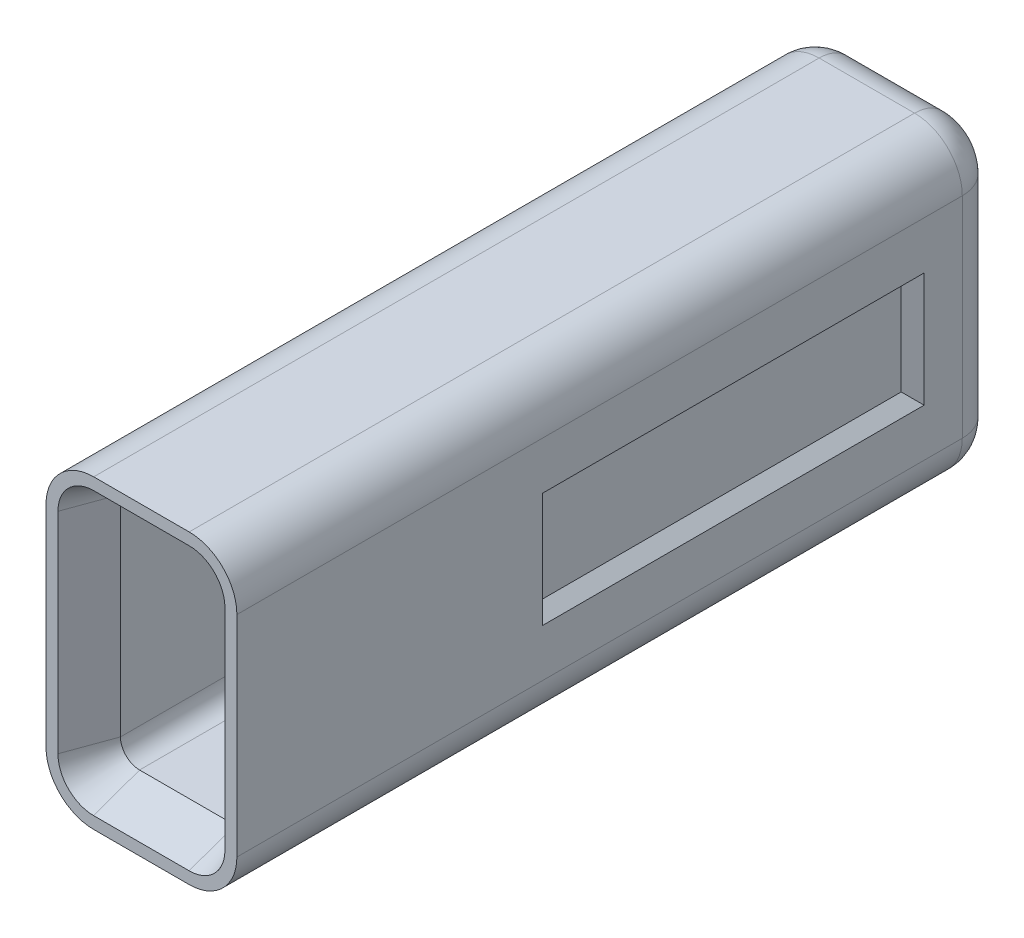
ISO-10303-21;
HEADER;
FILE_DESCRIPTION(('STEP AP214'),'2;1');
FILE_NAME('part.step','',(''),(''),'','','');
FILE_SCHEMA(('AUTOMOTIVE_DESIGN { 1 0 10303 214 1 1 1 1 }'));
ENDSEC;
DATA;
#1=APPLICATION_CONTEXT('core data for automotive mechanical design processes');
#2=APPLICATION_PROTOCOL_DEFINITION('international standard','automotive_design',2000,#1);
#3=PRODUCT_CONTEXT('',#1,'mechanical');
#4=PRODUCT('Part','Part','',(#3));
#5=PRODUCT_RELATED_PRODUCT_CATEGORY('part','',(#4));
#6=PRODUCT_DEFINITION_FORMATION('','',#4);
#7=PRODUCT_DEFINITION_CONTEXT('part definition',#1,'design');
#8=PRODUCT_DEFINITION('design','',#6,#7);
#9=PRODUCT_DEFINITION_SHAPE('','',#8);
#10=(LENGTH_UNIT() NAMED_UNIT(*) SI_UNIT(.MILLI.,.METRE.));
#11=(NAMED_UNIT(*) PLANE_ANGLE_UNIT() SI_UNIT($,.RADIAN.));
#12=(NAMED_UNIT(*) SI_UNIT($,.STERADIAN.) SOLID_ANGLE_UNIT());
#13=UNCERTAINTY_MEASURE_WITH_UNIT(LENGTH_MEASURE(1.E-05),#10,'distance_accuracy_value','');
#14=(GEOMETRIC_REPRESENTATION_CONTEXT(3) GLOBAL_UNCERTAINTY_ASSIGNED_CONTEXT((#13)) GLOBAL_UNIT_ASSIGNED_CONTEXT((#10,
#11,#12)) REPRESENTATION_CONTEXT('',''));
#15=CARTESIAN_POINT('',(0.,0.,0.));
#16=DIRECTION('',(0.,0.,1.));
#17=DIRECTION('',(1.,0.,0.));
#18=AXIS2_PLACEMENT_3D('',#15,#16,#17);
#19=CARTESIAN_POINT('',(2.5,2.75,19.));
#20=DIRECTION('',(-1.,0.,0.));
#21=DIRECTION('',(0.,0.,1.));
#22=AXIS2_PLACEMENT_3D('',#19,#20,#21);
#23=PLANE('',#22);
#24=DIRECTION('',(0.,0.,-1.));
#25=VECTOR('',#24,1.);
#26=CARTESIAN_POINT('',(2.5,-2.75,19.));
#27=LINE('',#26,#25);
#28=CARTESIAN_POINT('',(2.5,-2.75,19.));
#29=VERTEX_POINT('',#28);
#30=CARTESIAN_POINT('',(2.5,-2.75,0.));
#31=VERTEX_POINT('',#30);
#32=EDGE_CURVE('E353',#29,#31,#27,.T.);
#33=ORIENTED_EDGE('',*,*,#32,.T.);
#34=DIRECTION('',(0.,-1.,0.));
#35=VECTOR('',#34,1.);
#36=CARTESIAN_POINT('',(2.5,2.75,0.));
#37=LINE('',#36,#35);
#38=CARTESIAN_POINT('',(2.5,2.75,0.));
#39=VERTEX_POINT('',#38);
#40=EDGE_CURVE('E444',#31,#39,#37,.F.);
#41=ORIENTED_EDGE('',*,*,#40,.T.);
#42=DIRECTION('',(0.,0.,-1.));
#43=VECTOR('',#42,1.);
#44=CARTESIAN_POINT('',(2.5,2.75,19.));
#45=LINE('',#44,#43);
#46=CARTESIAN_POINT('',(2.5,2.75,19.));
#47=VERTEX_POINT('',#46);
#48=EDGE_CURVE('E350',#47,#39,#45,.T.);
#49=ORIENTED_EDGE('',*,*,#48,.F.);
#50=DIRECTION('',(0.,1.,0.));
#51=VECTOR('',#50,1.);
#52=CARTESIAN_POINT('',(2.5,2.75,19.));
#53=LINE('',#52,#51);
#54=EDGE_CURVE('E328',#29,#47,#53,.T.);
#55=ORIENTED_EDGE('',*,*,#54,.F.);
#56=EDGE_LOOP('',(#33,#41,#49,#55));
#57=FACE_BOUND('',#56,.T.);
#58=DIRECTION('',(0.,0.,1.));
#59=VECTOR('',#58,1.);
#60=CARTESIAN_POINT('',(2.5,-1.5,1.));
#61=LINE('',#60,#59);
#62=CARTESIAN_POINT('',(2.5,-1.5,1.));
#63=VERTEX_POINT('',#62);
#64=CARTESIAN_POINT('',(2.5,-1.5,11.));
#65=VERTEX_POINT('',#64);
#66=EDGE_CURVE('E255',#63,#65,#61,.T.);
#67=ORIENTED_EDGE('',*,*,#66,.T.);
#68=DIRECTION('',(0.,1.,0.));
#69=VECTOR('',#68,1.);
#70=CARTESIAN_POINT('',(2.5,-1.5,11.));
#71=LINE('',#70,#69);
#72=CARTESIAN_POINT('',(2.5,1.5,11.));
#73=VERTEX_POINT('',#72);
#74=EDGE_CURVE('E262',#65,#73,#71,.T.);
#75=ORIENTED_EDGE('',*,*,#74,.T.);
#76=DIRECTION('',(0.,0.,1.));
#77=VECTOR('',#76,1.);
#78=CARTESIAN_POINT('',(2.5,1.5,1.));
#79=LINE('',#78,#77);
#80=CARTESIAN_POINT('',(2.5,1.5,1.));
#81=VERTEX_POINT('',#80);
#82=EDGE_CURVE('E259',#81,#73,#79,.T.);
#83=ORIENTED_EDGE('',*,*,#82,.F.);
#84=DIRECTION('',(0.,1.,0.));
#85=VECTOR('',#84,1.);
#86=CARTESIAN_POINT('',(2.5,-1.5,1.));
#87=LINE('',#86,#85);
#88=EDGE_CURVE('E248',#63,#81,#87,.T.);
#89=ORIENTED_EDGE('',*,*,#88,.F.);
#90=EDGE_LOOP('',(#67,#75,#83,#89));
#91=FACE_BOUND('',#90,.T.);
#92=ADVANCED_FACE('F35',(#57,#91),#23,.F.);
#93=CARTESIAN_POINT('',(-2.5,-2.75,19.));
#94=DIRECTION('',(1.,0.,0.));
#95=DIRECTION('',(0.,0.,-1.));
#96=AXIS2_PLACEMENT_3D('',#93,#94,#95);
#97=PLANE('',#96);
#98=DIRECTION('',(0.,0.,-1.));
#99=VECTOR('',#98,1.);
#100=CARTESIAN_POINT('',(-2.5,2.75,19.));
#101=LINE('',#100,#99);
#102=CARTESIAN_POINT('',(-2.5,2.75,19.));
#103=VERTEX_POINT('',#102);
#104=CARTESIAN_POINT('',(-2.5,2.75,0.));
#105=VERTEX_POINT('',#104);
#106=EDGE_CURVE('E341',#103,#105,#101,.T.);
#107=ORIENTED_EDGE('',*,*,#106,.T.);
#108=DIRECTION('',(0.,1.,0.));
#109=VECTOR('',#108,1.);
#110=CARTESIAN_POINT('',(-2.5,-2.75,0.));
#111=LINE('',#110,#109);
#112=CARTESIAN_POINT('',(-2.5,-2.75,0.));
#113=VERTEX_POINT('',#112);
#114=EDGE_CURVE('E435',#105,#113,#111,.F.);
#115=ORIENTED_EDGE('',*,*,#114,.T.);
#116=DIRECTION('',(0.,0.,-1.));
#117=VECTOR('',#116,1.);
#118=CARTESIAN_POINT('',(-2.5,-2.75,19.));
#119=LINE('',#118,#117);
#120=CARTESIAN_POINT('',(-2.5,-2.75,19.));
#121=VERTEX_POINT('',#120);
#122=EDGE_CURVE('E338',#121,#113,#119,.T.);
#123=ORIENTED_EDGE('',*,*,#122,.F.);
#124=DIRECTION('',(0.,-1.,0.));
#125=VECTOR('',#124,1.);
#126=CARTESIAN_POINT('',(-2.5,-2.75,19.));
#127=LINE('',#126,#125);
#128=EDGE_CURVE('E336',#103,#121,#127,.T.);
#129=ORIENTED_EDGE('',*,*,#128,.F.);
#130=EDGE_LOOP('',(#107,#115,#123,#129));
#131=FACE_BOUND('',#130,.T.);
#132=DIRECTION('',(0.,0.,1.));
#133=VECTOR('',#132,1.);
#134=CARTESIAN_POINT('',(-2.5,-1.5,1.));
#135=LINE('',#134,#133);
#136=CARTESIAN_POINT('',(-2.5,-1.5,1.));
#137=VERTEX_POINT('',#136);
#138=CARTESIAN_POINT('',(-2.5,-1.5,11.));
#139=VERTEX_POINT('',#138);
#140=EDGE_CURVE('E268',#137,#139,#135,.T.);
#141=ORIENTED_EDGE('',*,*,#140,.F.);
#142=DIRECTION('',(0.,1.,0.));
#143=VECTOR('',#142,1.);
#144=CARTESIAN_POINT('',(-2.5,-1.5,1.));
#145=LINE('',#144,#143);
#146=CARTESIAN_POINT('',(-2.5,1.5,1.));
#147=VERTEX_POINT('',#146);
#148=EDGE_CURVE('E275',#137,#147,#145,.T.);
#149=ORIENTED_EDGE('',*,*,#148,.T.);
#150=DIRECTION('',(0.,0.,1.));
#151=VECTOR('',#150,1.);
#152=CARTESIAN_POINT('',(-2.5,1.5,1.));
#153=LINE('',#152,#151);
#154=CARTESIAN_POINT('',(-2.5,1.5,11.));
#155=VERTEX_POINT('',#154);
#156=EDGE_CURVE('E272',#147,#155,#153,.T.);
#157=ORIENTED_EDGE('',*,*,#156,.T.);
#158=DIRECTION('',(0.,1.,0.));
#159=VECTOR('',#158,1.);
#160=CARTESIAN_POINT('',(-2.5,-1.5,11.));
#161=LINE('',#160,#159);
#162=EDGE_CURVE('E271',#139,#155,#161,.T.);
#163=ORIENTED_EDGE('',*,*,#162,.F.);
#164=EDGE_LOOP('',(#141,#149,#157,#163));
#165=FACE_BOUND('',#164,.T.);
#166=ADVANCED_FACE('F512',(#131,#165),#97,.F.);
#167=CARTESIAN_POINT('',(-1.25,-2.75,19.));
#168=DIRECTION('',(0.,0.,-1.));
#169=DIRECTION('',(-1.,0.,0.));
#170=AXIS2_PLACEMENT_3D('',#167,#168,#169);
#171=PLANE('',#170);
#172=CARTESIAN_POINT('',(1.25,-2.75,19.));
#173=DIRECTION('',(0.,0.,-1.));
#174=DIRECTION('',(-1.,0.,0.));
#175=AXIS2_PLACEMENT_3D('',#172,#173,#174);
#176=CIRCLE('',#175,0.936764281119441);
#177=CARTESIAN_POINT('',(2.18676428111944,-2.74999999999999,19.));
#178=VERTEX_POINT('',#177);
#179=CARTESIAN_POINT('',(1.25,-3.68676428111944,19.));
#180=VERTEX_POINT('',#179);
#181=EDGE_CURVE('E377',#178,#180,#176,.T.);
#182=ORIENTED_EDGE('',*,*,#181,.T.);
#183=DIRECTION('',(-1.,0.,0.));
#184=VECTOR('',#183,1.);
#185=CARTESIAN_POINT('',(-1.25,-3.68676428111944,19.));
#186=LINE('',#185,#184);
#187=CARTESIAN_POINT('',(-1.25,-3.68676428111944,19.));
#188=VERTEX_POINT('',#187);
#189=EDGE_CURVE('E379',#180,#188,#186,.T.);
#190=ORIENTED_EDGE('',*,*,#189,.T.);
#191=CARTESIAN_POINT('',(-1.25,-2.75,19.));
#192=DIRECTION('',(0.,0.,-1.));
#193=DIRECTION('',(-1.,0.,0.));
#194=AXIS2_PLACEMENT_3D('',#191,#192,#193);
#195=CIRCLE('',#194,0.936764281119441);
#196=CARTESIAN_POINT('',(-2.18676428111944,-2.75,19.));
#197=VERTEX_POINT('',#196);
#198=EDGE_CURVE('E365',#188,#197,#195,.T.);
#199=ORIENTED_EDGE('',*,*,#198,.T.);
#200=DIRECTION('',(0.,1.,0.));
#201=VECTOR('',#200,1.);
#202=CARTESIAN_POINT('',(-2.18676428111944,2.75,19.));
#203=LINE('',#202,#201);
#204=CARTESIAN_POINT('',(-2.18676428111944,2.74999999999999,19.));
#205=VERTEX_POINT('',#204);
#206=EDGE_CURVE('E367',#197,#205,#203,.T.);
#207=ORIENTED_EDGE('',*,*,#206,.T.);
#208=CARTESIAN_POINT('',(-1.25,2.75,19.));
#209=DIRECTION('',(0.,0.,-1.));
#210=DIRECTION('',(-1.,0.,0.));
#211=AXIS2_PLACEMENT_3D('',#208,#209,#210);
#212=CIRCLE('',#211,0.936764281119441);
#213=CARTESIAN_POINT('',(-1.25,3.68676428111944,19.));
#214=VERTEX_POINT('',#213);
#215=EDGE_CURVE('E369',#205,#214,#212,.T.);
#216=ORIENTED_EDGE('',*,*,#215,.T.);
#217=DIRECTION('',(1.,0.,0.));
#218=VECTOR('',#217,1.);
#219=CARTESIAN_POINT('',(1.25,3.68676428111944,19.));
#220=LINE('',#219,#218);
#221=CARTESIAN_POINT('',(1.24999999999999,3.68676428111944,19.));
#222=VERTEX_POINT('',#221);
#223=EDGE_CURVE('E371',#214,#222,#220,.T.);
#224=ORIENTED_EDGE('',*,*,#223,.T.);
#225=CARTESIAN_POINT('',(1.25,2.75,19.));
#226=DIRECTION('',(0.,0.,-1.));
#227=DIRECTION('',(-1.,0.,0.));
#228=AXIS2_PLACEMENT_3D('',#225,#226,#227);
#229=CIRCLE('',#228,0.936764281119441);
#230=CARTESIAN_POINT('',(2.18676428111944,2.75,19.));
#231=VERTEX_POINT('',#230);
#232=EDGE_CURVE('E373',#222,#231,#229,.T.);
#233=ORIENTED_EDGE('',*,*,#232,.T.);
#234=DIRECTION('',(0.,-1.,0.));
#235=VECTOR('',#234,1.);
#236=CARTESIAN_POINT('',(2.18676428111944,-2.75,19.));
#237=LINE('',#236,#235);
#238=EDGE_CURVE('E375',#231,#178,#237,.T.);
#239=ORIENTED_EDGE('',*,*,#238,.T.);
#240=EDGE_LOOP('',(#182,#190,#199,#207,#216,#224,#233,#239));
#241=FACE_BOUND('',#240,.T.);
#242=CARTESIAN_POINT('',(-1.25,-2.75,19.));
#243=DIRECTION('',(0.,0.,1.));
#244=DIRECTION('',(-1.,0.,0.));
#245=AXIS2_PLACEMENT_3D('',#242,#243,#244);
#246=CIRCLE('',#245,1.25);
#247=CARTESIAN_POINT('',(-1.25,-4.,19.));
#248=VERTEX_POINT('',#247);
#249=EDGE_CURVE('E321',#121,#248,#246,.T.);
#250=ORIENTED_EDGE('',*,*,#249,.T.);
#251=DIRECTION('',(1.,0.,0.));
#252=VECTOR('',#251,1.);
#253=CARTESIAN_POINT('',(1.25,-4.,19.));
#254=LINE('',#253,#252);
#255=CARTESIAN_POINT('',(1.25,-4.,19.));
#256=VERTEX_POINT('',#255);
#257=EDGE_CURVE('E324',#248,#256,#254,.T.);
#258=ORIENTED_EDGE('',*,*,#257,.T.);
#259=CARTESIAN_POINT('',(1.25,-2.75,19.));
#260=DIRECTION('',(0.,0.,1.));
#261=DIRECTION('',(-1.,0.,0.));
#262=AXIS2_PLACEMENT_3D('',#259,#260,#261);
#263=CIRCLE('',#262,1.25);
#264=EDGE_CURVE('E326',#256,#29,#263,.T.);
#265=ORIENTED_EDGE('',*,*,#264,.T.);
#266=ORIENTED_EDGE('',*,*,#54,.T.);
#267=CARTESIAN_POINT('',(1.25,2.75,19.));
#268=DIRECTION('',(0.,0.,1.));
#269=DIRECTION('',(-1.,0.,0.));
#270=AXIS2_PLACEMENT_3D('',#267,#268,#269);
#271=CIRCLE('',#270,1.25);
#272=CARTESIAN_POINT('',(1.25,4.,19.));
#273=VERTEX_POINT('',#272);
#274=EDGE_CURVE('E330',#47,#273,#271,.T.);
#275=ORIENTED_EDGE('',*,*,#274,.T.);
#276=DIRECTION('',(-1.,0.,0.));
#277=VECTOR('',#276,1.);
#278=CARTESIAN_POINT('',(-1.25,4.,19.));
#279=LINE('',#278,#277);
#280=CARTESIAN_POINT('',(-1.25,4.,19.));
#281=VERTEX_POINT('',#280);
#282=EDGE_CURVE('E332',#273,#281,#279,.T.);
#283=ORIENTED_EDGE('',*,*,#282,.T.);
#284=CARTESIAN_POINT('',(-1.25,2.75,19.));
#285=DIRECTION('',(0.,0.,1.));
#286=DIRECTION('',(1.,0.,0.));
#287=AXIS2_PLACEMENT_3D('',#284,#285,#286);
#288=CIRCLE('',#287,1.25);
#289=EDGE_CURVE('E334',#281,#103,#288,.T.);
#290=ORIENTED_EDGE('',*,*,#289,.T.);
#291=ORIENTED_EDGE('',*,*,#128,.T.);
#292=EDGE_LOOP('',(#250,#258,#265,#266,#275,#283,#290,#291));
#293=FACE_BOUND('',#292,.T.);
#294=ADVANCED_FACE('F518',(#241,#293),#171,.F.);
#295=CARTESIAN_POINT('',(-1.25,-2.75,19.));
#296=DIRECTION('',(0.,0.,-1.));
#297=DIRECTION('',(-1.,0.,0.));
#298=AXIS2_PLACEMENT_3D('',#295,#296,#297);
#299=CYLINDRICAL_SURFACE('',#298,1.25);
#300=ORIENTED_EDGE('',*,*,#122,.T.);
#301=CARTESIAN_POINT('',(-1.25,-2.75,0.));
#302=DIRECTION('',(0.,0.,1.));
#303=DIRECTION('',(1.,0.,0.));
#304=AXIS2_PLACEMENT_3D('',#301,#302,#303);
#305=CIRCLE('',#304,1.25);
#306=CARTESIAN_POINT('',(-1.25,-4.,0.));
#307=VERTEX_POINT('',#306);
#308=EDGE_CURVE('E438',#113,#307,#305,.T.);
#309=ORIENTED_EDGE('',*,*,#308,.T.);
#310=DIRECTION('',(0.,0.,-1.));
#311=VECTOR('',#310,1.);
#312=CARTESIAN_POINT('',(-1.25,-4.,19.));
#313=LINE('',#312,#311);
#314=EDGE_CURVE('E359',#248,#307,#313,.T.);
#315=ORIENTED_EDGE('',*,*,#314,.F.);
#316=ORIENTED_EDGE('',*,*,#249,.F.);
#317=EDGE_LOOP('',(#300,#309,#315,#316));
#318=FACE_BOUND('',#317,.T.);
#319=ADVANCED_FACE('F532',(#318),#299,.T.);
#320=CARTESIAN_POINT('',(1.25,-4.,19.));
#321=DIRECTION('',(0.,1.,0.));
#322=DIRECTION('',(0.,0.,1.));
#323=AXIS2_PLACEMENT_3D('',#320,#321,#322);
#324=PLANE('',#323);
#325=ORIENTED_EDGE('',*,*,#314,.T.);
#326=DIRECTION('',(-1.,0.,0.));
#327=VECTOR('',#326,1.);
#328=CARTESIAN_POINT('',(1.25,-4.,0.));
#329=LINE('',#328,#327);
#330=CARTESIAN_POINT('',(1.25,-4.,0.));
#331=VERTEX_POINT('',#330);
#332=EDGE_CURVE('E440',#307,#331,#329,.F.);
#333=ORIENTED_EDGE('',*,*,#332,.T.);
#334=DIRECTION('',(0.,0.,-1.));
#335=VECTOR('',#334,1.);
#336=CARTESIAN_POINT('',(1.25,-4.,19.));
#337=LINE('',#336,#335);
#338=EDGE_CURVE('E356',#256,#331,#337,.T.);
#339=ORIENTED_EDGE('',*,*,#338,.F.);
#340=ORIENTED_EDGE('',*,*,#257,.F.);
#341=EDGE_LOOP('',(#325,#333,#339,#340));
#342=FACE_BOUND('',#341,.T.);
#343=ADVANCED_FACE('F528',(#342),#324,.F.);
#344=CARTESIAN_POINT('',(1.25,-2.75,19.));
#345=DIRECTION('',(0.,0.,-1.));
#346=DIRECTION('',(-1.,0.,0.));
#347=AXIS2_PLACEMENT_3D('',#344,#345,#346);
#348=CYLINDRICAL_SURFACE('',#347,1.25);
#349=ORIENTED_EDGE('',*,*,#338,.T.);
#350=CARTESIAN_POINT('',(1.25,-2.75,0.));
#351=DIRECTION('',(0.,0.,1.));
#352=DIRECTION('',(1.,0.,0.));
#353=AXIS2_PLACEMENT_3D('',#350,#351,#352);
#354=CIRCLE('',#353,1.25);
#355=EDGE_CURVE('E442',#331,#31,#354,.T.);
#356=ORIENTED_EDGE('',*,*,#355,.T.);
#357=ORIENTED_EDGE('',*,*,#32,.F.);
#358=ORIENTED_EDGE('',*,*,#264,.F.);
#359=EDGE_LOOP('',(#349,#356,#357,#358));
#360=FACE_BOUND('',#359,.T.);
#361=ADVANCED_FACE('F525',(#360),#348,.T.);
#362=CARTESIAN_POINT('',(1.25,2.75,19.));
#363=DIRECTION('',(0.,0.,-1.));
#364=DIRECTION('',(-1.,0.,0.));
#365=AXIS2_PLACEMENT_3D('',#362,#363,#364);
#366=CYLINDRICAL_SURFACE('',#365,1.25);
#367=ORIENTED_EDGE('',*,*,#48,.T.);
#368=CARTESIAN_POINT('',(1.25,2.75,0.));
#369=DIRECTION('',(0.,0.,1.));
#370=DIRECTION('',(1.,0.,0.));
#371=AXIS2_PLACEMENT_3D('',#368,#369,#370);
#372=CIRCLE('',#371,1.25);
#373=CARTESIAN_POINT('',(1.25,4.,0.));
#374=VERTEX_POINT('',#373);
#375=EDGE_CURVE('E446',#39,#374,#372,.T.);
#376=ORIENTED_EDGE('',*,*,#375,.T.);
#377=DIRECTION('',(0.,0.,-1.));
#378=VECTOR('',#377,1.);
#379=CARTESIAN_POINT('',(1.25,4.,19.));
#380=LINE('',#379,#378);
#381=EDGE_CURVE('E347',#273,#374,#380,.T.);
#382=ORIENTED_EDGE('',*,*,#381,.F.);
#383=ORIENTED_EDGE('',*,*,#274,.F.);
#384=EDGE_LOOP('',(#367,#376,#382,#383));
#385=FACE_BOUND('',#384,.T.);
#386=ADVANCED_FACE('F523',(#385),#366,.T.);
#387=CARTESIAN_POINT('',(-1.25,4.,19.));
#388=DIRECTION('',(0.,-1.,0.));
#389=DIRECTION('',(0.,0.,-1.));
#390=AXIS2_PLACEMENT_3D('',#387,#388,#389);
#391=PLANE('',#390);
#392=ORIENTED_EDGE('',*,*,#381,.T.);
#393=DIRECTION('',(1.,0.,0.));
#394=VECTOR('',#393,1.);
#395=CARTESIAN_POINT('',(-1.25,4.,0.));
#396=LINE('',#395,#394);
#397=CARTESIAN_POINT('',(-1.25,4.,0.));
#398=VERTEX_POINT('',#397);
#399=EDGE_CURVE('E448',#374,#398,#396,.F.);
#400=ORIENTED_EDGE('',*,*,#399,.T.);
#401=DIRECTION('',(0.,0.,-1.));
#402=VECTOR('',#401,1.);
#403=CARTESIAN_POINT('',(-1.25,4.,19.));
#404=LINE('',#403,#402);
#405=EDGE_CURVE('E344',#281,#398,#404,.T.);
#406=ORIENTED_EDGE('',*,*,#405,.F.);
#407=ORIENTED_EDGE('',*,*,#282,.F.);
#408=EDGE_LOOP('',(#392,#400,#406,#407));
#409=FACE_BOUND('',#408,.T.);
#410=ADVANCED_FACE('F762',(#409),#391,.F.);
#411=CARTESIAN_POINT('',(-1.25,2.75,19.));
#412=DIRECTION('',(0.,0.,-1.));
#413=DIRECTION('',(-1.,0.,0.));
#414=AXIS2_PLACEMENT_3D('',#411,#412,#413);
#415=CYLINDRICAL_SURFACE('',#414,1.25);
#416=ORIENTED_EDGE('',*,*,#405,.T.);
#417=CARTESIAN_POINT('',(-1.25,2.75,0.));
#418=DIRECTION('',(0.,0.,1.));
#419=DIRECTION('',(1.,0.,0.));
#420=AXIS2_PLACEMENT_3D('',#417,#418,#419);
#421=CIRCLE('',#420,1.25);
#422=EDGE_CURVE('E450',#398,#105,#421,.T.);
#423=ORIENTED_EDGE('',*,*,#422,.T.);
#424=ORIENTED_EDGE('',*,*,#106,.F.);
#425=ORIENTED_EDGE('',*,*,#289,.F.);
#426=EDGE_LOOP('',(#416,#423,#424,#425));
#427=FACE_BOUND('',#426,.T.);
#428=ADVANCED_FACE('F756',(#427),#415,.T.);
#429=CARTESIAN_POINT('',(-1.25,-2.75,19.));
#430=DIRECTION('',(0.,0.,-1.));
#431=DIRECTION('',(-1.,0.,0.));
#432=AXIS2_PLACEMENT_3D('',#429,#430,#431);
#433=CYLINDRICAL_SURFACE('',#432,0.5);
#434=DIRECTION('',(0.,0.,-1.));
#435=VECTOR('',#434,1.);
#436=CARTESIAN_POINT('',(-1.75,-2.75,19.));
#437=LINE('',#436,#435);
#438=CARTESIAN_POINT('',(-1.75,-2.75,17.8));
#439=VERTEX_POINT('',#438);
#440=CARTESIAN_POINT('',(-1.75,-2.75,0.));
#441=VERTEX_POINT('',#440);
#442=EDGE_CURVE('E305',#439,#441,#437,.T.);
#443=ORIENTED_EDGE('',*,*,#442,.F.);
#444=CARTESIAN_POINT('',(-1.25,-2.75,17.8));
#445=DIRECTION('',(0.,0.,-1.));
#446=DIRECTION('',(-1.,0.,0.));
#447=AXIS2_PLACEMENT_3D('',#444,#445,#446);
#448=CIRCLE('',#447,0.5);
#449=CARTESIAN_POINT('',(-1.25,-3.25,17.8));
#450=VERTEX_POINT('',#449);
#451=EDGE_CURVE('E394',#439,#450,#448,.F.);
#452=ORIENTED_EDGE('',*,*,#451,.T.);
#453=DIRECTION('',(0.,0.,-1.));
#454=VECTOR('',#453,1.);
#455=CARTESIAN_POINT('',(-1.25,-3.25,19.));
#456=LINE('',#455,#454);
#457=CARTESIAN_POINT('',(-1.25,-3.25,0.));
#458=VERTEX_POINT('',#457);
#459=EDGE_CURVE('E319',#450,#458,#456,.T.);
#460=ORIENTED_EDGE('',*,*,#459,.T.);
#461=CARTESIAN_POINT('',(-1.25,-2.75,0.));
#462=DIRECTION('',(0.,0.,1.));
#463=DIRECTION('',(-1.,0.,0.));
#464=AXIS2_PLACEMENT_3D('',#461,#462,#463);
#465=CIRCLE('',#464,0.5);
#466=EDGE_CURVE('E280',#441,#458,#465,.T.);
#467=ORIENTED_EDGE('',*,*,#466,.F.);
#468=EDGE_LOOP('',(#443,#452,#460,#467));
#469=FACE_BOUND('',#468,.T.);
#470=ADVANCED_FACE('F761',(#469),#433,.F.);
#471=CARTESIAN_POINT('',(-1.25,-3.25,19.));
#472=DIRECTION('',(0.,1.,0.));
#473=DIRECTION('',(0.,0.,1.));
#474=AXIS2_PLACEMENT_3D('',#471,#472,#473);
#475=PLANE('',#474);
#476=ORIENTED_EDGE('',*,*,#459,.F.);
#477=DIRECTION('',(1.,0.,0.));
#478=VECTOR('',#477,1.);
#479=CARTESIAN_POINT('',(1.25,-3.25,17.8));
#480=LINE('',#479,#478);
#481=CARTESIAN_POINT('',(1.25,-3.25,17.8));
#482=VERTEX_POINT('',#481);
#483=EDGE_CURVE('E362',#450,#482,#480,.T.);
#484=ORIENTED_EDGE('',*,*,#483,.T.);
#485=DIRECTION('',(0.,0.,-1.));
#486=VECTOR('',#485,1.);
#487=CARTESIAN_POINT('',(1.25,-3.25,19.));
#488=LINE('',#487,#486);
#489=CARTESIAN_POINT('',(1.25,-3.25,0.));
#490=VERTEX_POINT('',#489);
#491=EDGE_CURVE('E317',#482,#490,#488,.T.);
#492=ORIENTED_EDGE('',*,*,#491,.T.);
#493=DIRECTION('',(1.,0.,0.));
#494=VECTOR('',#493,1.);
#495=CARTESIAN_POINT('',(-1.25,-3.25,0.));
#496=LINE('',#495,#494);
#497=EDGE_CURVE('E283',#458,#490,#496,.T.);
#498=ORIENTED_EDGE('',*,*,#497,.F.);
#499=EDGE_LOOP('',(#476,#484,#492,#498));
#500=FACE_BOUND('',#499,.T.);
#501=ADVANCED_FACE('F910',(#500),#475,.T.);
#502=CARTESIAN_POINT('',(1.25,-2.75,19.));
#503=DIRECTION('',(0.,0.,-1.));
#504=DIRECTION('',(-1.,0.,0.));
#505=AXIS2_PLACEMENT_3D('',#502,#503,#504);
#506=CYLINDRICAL_SURFACE('',#505,0.5);
#507=ORIENTED_EDGE('',*,*,#491,.F.);
#508=CARTESIAN_POINT('',(1.25,-2.75,17.8));
#509=DIRECTION('',(0.,0.,-1.));
#510=DIRECTION('',(-1.,0.,0.));
#511=AXIS2_PLACEMENT_3D('',#508,#509,#510);
#512=CIRCLE('',#511,0.5);
#513=CARTESIAN_POINT('',(1.75,-2.75,17.8));
#514=VERTEX_POINT('',#513);
#515=EDGE_CURVE('E382',#482,#514,#512,.F.);
#516=ORIENTED_EDGE('',*,*,#515,.T.);
#517=DIRECTION('',(0.,0.,-1.));
#518=VECTOR('',#517,1.);
#519=CARTESIAN_POINT('',(1.75,-2.75,19.));
#520=LINE('',#519,#518);
#521=CARTESIAN_POINT('',(1.75,-2.75,0.));
#522=VERTEX_POINT('',#521);
#523=EDGE_CURVE('E315',#514,#522,#520,.T.);
#524=ORIENTED_EDGE('',*,*,#523,.T.);
#525=CARTESIAN_POINT('',(1.25,-2.75,0.));
#526=DIRECTION('',(0.,0.,1.));
#527=DIRECTION('',(1.,0.,0.));
#528=AXIS2_PLACEMENT_3D('',#525,#526,#527);
#529=CIRCLE('',#528,0.5);
#530=EDGE_CURVE('E287',#490,#522,#529,.T.);
#531=ORIENTED_EDGE('',*,*,#530,.F.);
#532=EDGE_LOOP('',(#507,#516,#524,#531));
#533=FACE_BOUND('',#532,.T.);
#534=ADVANCED_FACE('F900',(#533),#506,.F.);
#535=CARTESIAN_POINT('',(1.75,-2.75,19.));
#536=DIRECTION('',(-1.,0.,0.));
#537=DIRECTION('',(0.,0.,1.));
#538=AXIS2_PLACEMENT_3D('',#535,#536,#537);
#539=PLANE('',#538);
#540=ORIENTED_EDGE('',*,*,#523,.F.);
#541=DIRECTION('',(0.,1.,0.));
#542=VECTOR('',#541,1.);
#543=CARTESIAN_POINT('',(1.75,2.75,17.8));
#544=LINE('',#543,#542);
#545=CARTESIAN_POINT('',(1.75,2.75,17.8));
#546=VERTEX_POINT('',#545);
#547=EDGE_CURVE('E384',#514,#546,#544,.T.);
#548=ORIENTED_EDGE('',*,*,#547,.T.);
#549=DIRECTION('',(0.,0.,-1.));
#550=VECTOR('',#549,1.);
#551=CARTESIAN_POINT('',(1.75,2.75,19.));
#552=LINE('',#551,#550);
#553=CARTESIAN_POINT('',(1.75,2.75,0.));
#554=VERTEX_POINT('',#553);
#555=EDGE_CURVE('E313',#546,#554,#552,.T.);
#556=ORIENTED_EDGE('',*,*,#555,.T.);
#557=DIRECTION('',(0.,1.,0.));
#558=VECTOR('',#557,1.);
#559=CARTESIAN_POINT('',(1.75,-2.75,0.));
#560=LINE('',#559,#558);
#561=EDGE_CURVE('E290',#522,#554,#560,.T.);
#562=ORIENTED_EDGE('',*,*,#561,.F.);
#563=EDGE_LOOP('',(#540,#548,#556,#562));
#564=FACE_BOUND('',#563,.T.);
#565=ADVANCED_FACE('F890',(#564),#539,.T.);
#566=CARTESIAN_POINT('',(1.25,2.75,19.));
#567=DIRECTION('',(0.,0.,-1.));
#568=DIRECTION('',(-1.,0.,0.));
#569=AXIS2_PLACEMENT_3D('',#566,#567,#568);
#570=CYLINDRICAL_SURFACE('',#569,0.5);
#571=ORIENTED_EDGE('',*,*,#555,.F.);
#572=CARTESIAN_POINT('',(1.25,2.75,17.8));
#573=DIRECTION('',(0.,0.,-1.));
#574=DIRECTION('',(-1.,0.,0.));
#575=AXIS2_PLACEMENT_3D('',#572,#573,#574);
#576=CIRCLE('',#575,0.5);
#577=CARTESIAN_POINT('',(1.25,3.25,17.8));
#578=VERTEX_POINT('',#577);
#579=EDGE_CURVE('E386',#546,#578,#576,.F.);
#580=ORIENTED_EDGE('',*,*,#579,.T.);
#581=DIRECTION('',(0.,0.,-1.));
#582=VECTOR('',#581,1.);
#583=CARTESIAN_POINT('',(1.25,3.25,19.));
#584=LINE('',#583,#582);
#585=CARTESIAN_POINT('',(1.25,3.25,0.));
#586=VERTEX_POINT('',#585);
#587=EDGE_CURVE('E311',#578,#586,#584,.T.);
#588=ORIENTED_EDGE('',*,*,#587,.T.);
#589=CARTESIAN_POINT('',(1.25,2.75,0.));
#590=DIRECTION('',(0.,0.,1.));
#591=DIRECTION('',(-1.,0.,0.));
#592=AXIS2_PLACEMENT_3D('',#589,#590,#591);
#593=CIRCLE('',#592,0.5);
#594=EDGE_CURVE('E293',#554,#586,#593,.T.);
#595=ORIENTED_EDGE('',*,*,#594,.F.);
#596=EDGE_LOOP('',(#571,#580,#588,#595));
#597=FACE_BOUND('',#596,.T.);
#598=ADVANCED_FACE('F880',(#597),#570,.F.);
#599=CARTESIAN_POINT('',(-1.25,3.25,19.));
#600=DIRECTION('',(0.,-1.,0.));
#601=DIRECTION('',(0.,0.,-1.));
#602=AXIS2_PLACEMENT_3D('',#599,#600,#601);
#603=PLANE('',#602);
#604=ORIENTED_EDGE('',*,*,#587,.F.);
#605=DIRECTION('',(-1.,0.,0.));
#606=VECTOR('',#605,1.);
#607=CARTESIAN_POINT('',(-1.25,3.25,17.8));
#608=LINE('',#607,#606);
#609=CARTESIAN_POINT('',(-1.25,3.25,17.8));
#610=VERTEX_POINT('',#609);
#611=EDGE_CURVE('E388',#578,#610,#608,.T.);
#612=ORIENTED_EDGE('',*,*,#611,.T.);
#613=DIRECTION('',(0.,0.,-1.));
#614=VECTOR('',#613,1.);
#615=CARTESIAN_POINT('',(-1.25,3.25,19.));
#616=LINE('',#615,#614);
#617=CARTESIAN_POINT('',(-1.25,3.25,0.));
#618=VERTEX_POINT('',#617);
#619=EDGE_CURVE('E309',#610,#618,#616,.T.);
#620=ORIENTED_EDGE('',*,*,#619,.T.);
#621=DIRECTION('',(-1.,0.,0.));
#622=VECTOR('',#621,1.);
#623=CARTESIAN_POINT('',(-1.25,3.25,0.));
#624=LINE('',#623,#622);
#625=EDGE_CURVE('E296',#586,#618,#624,.T.);
#626=ORIENTED_EDGE('',*,*,#625,.F.);
#627=EDGE_LOOP('',(#604,#612,#620,#626));
#628=FACE_BOUND('',#627,.T.);
#629=ADVANCED_FACE('F870',(#628),#603,.T.);
#630=CARTESIAN_POINT('',(-1.25,2.75,19.));
#631=DIRECTION('',(0.,0.,-1.));
#632=DIRECTION('',(-1.,0.,0.));
#633=AXIS2_PLACEMENT_3D('',#630,#631,#632);
#634=CYLINDRICAL_SURFACE('',#633,0.5);
#635=ORIENTED_EDGE('',*,*,#619,.F.);
#636=CARTESIAN_POINT('',(-1.25,2.75,17.8));
#637=DIRECTION('',(0.,0.,-1.));
#638=DIRECTION('',(-1.,0.,0.));
#639=AXIS2_PLACEMENT_3D('',#636,#637,#638);
#640=CIRCLE('',#639,0.5);
#641=CARTESIAN_POINT('',(-1.75,2.75,17.8));
#642=VERTEX_POINT('',#641);
#643=EDGE_CURVE('E390',#610,#642,#640,.F.);
#644=ORIENTED_EDGE('',*,*,#643,.T.);
#645=DIRECTION('',(0.,0.,-1.));
#646=VECTOR('',#645,1.);
#647=CARTESIAN_POINT('',(-1.75,2.75,19.));
#648=LINE('',#647,#646);
#649=CARTESIAN_POINT('',(-1.75,2.75,0.));
#650=VERTEX_POINT('',#649);
#651=EDGE_CURVE('E307',#642,#650,#648,.T.);
#652=ORIENTED_EDGE('',*,*,#651,.T.);
#653=CARTESIAN_POINT('',(-1.25,2.75,0.));
#654=DIRECTION('',(0.,0.,1.));
#655=DIRECTION('',(-1.,0.,0.));
#656=AXIS2_PLACEMENT_3D('',#653,#654,#655);
#657=CIRCLE('',#656,0.5);
#658=EDGE_CURVE('E299',#618,#650,#657,.T.);
#659=ORIENTED_EDGE('',*,*,#658,.F.);
#660=EDGE_LOOP('',(#635,#644,#652,#659));
#661=FACE_BOUND('',#660,.T.);
#662=ADVANCED_FACE('F860',(#661),#634,.F.);
#663=CARTESIAN_POINT('',(-1.75,-2.75,19.));
#664=DIRECTION('',(1.,0.,0.));
#665=DIRECTION('',(0.,0.,-1.));
#666=AXIS2_PLACEMENT_3D('',#663,#664,#665);
#667=PLANE('',#666);
#668=ORIENTED_EDGE('',*,*,#651,.F.);
#669=DIRECTION('',(0.,-1.,0.));
#670=VECTOR('',#669,1.);
#671=CARTESIAN_POINT('',(-1.75,-2.75,17.8));
#672=LINE('',#671,#670);
#673=EDGE_CURVE('E392',#642,#439,#672,.T.);
#674=ORIENTED_EDGE('',*,*,#673,.T.);
#675=ORIENTED_EDGE('',*,*,#442,.T.);
#676=DIRECTION('',(0.,-1.,0.));
#677=VECTOR('',#676,1.);
#678=CARTESIAN_POINT('',(-1.75,-2.75,0.));
#679=LINE('',#678,#677);
#680=EDGE_CURVE('E302',#650,#441,#679,.T.);
#681=ORIENTED_EDGE('',*,*,#680,.F.);
#682=EDGE_LOOP('',(#668,#674,#675,#681));
#683=FACE_BOUND('',#682,.T.);
#684=ADVANCED_FACE('F856',(#683),#667,.T.);
#685=CARTESIAN_POINT('',(-1.25,2.75,0.));
#686=DIRECTION('',(0.,0.,1.));
#687=DIRECTION('',(1.,0.,0.));
#688=AXIS2_PLACEMENT_3D('',#685,#686,#687);
#689=PLANE('',#688);
#690=ORIENTED_EDGE('',*,*,#680,.T.);
#691=ORIENTED_EDGE('',*,*,#466,.T.);
#692=ORIENTED_EDGE('',*,*,#497,.T.);
#693=ORIENTED_EDGE('',*,*,#530,.T.);
#694=ORIENTED_EDGE('',*,*,#561,.T.);
#695=ORIENTED_EDGE('',*,*,#594,.T.);
#696=ORIENTED_EDGE('',*,*,#625,.T.);
#697=ORIENTED_EDGE('',*,*,#658,.T.);
#698=EDGE_LOOP('',(#690,#691,#692,#693,#694,#695,#696,#697));
#699=FACE_BOUND('',#698,.T.);
#700=ADVANCED_FACE('F747',(#699),#689,.T.);
#701=CARTESIAN_POINT('',(-1.25,2.75,-1.));
#702=DIRECTION('',(0.,0.,1.));
#703=DIRECTION('',(1.,0.,0.));
#704=AXIS2_PLACEMENT_3D('',#701,#702,#703);
#705=PLANE('',#704);
#706=CARTESIAN_POINT('',(-1.25,-2.75,-1.));
#707=DIRECTION('',(0.,0.,1.));
#708=DIRECTION('',(1.,0.,0.));
#709=AXIS2_PLACEMENT_3D('',#706,#707,#708);
#710=CIRCLE('',#709,0.25);
#711=CARTESIAN_POINT('',(-1.25,-3.,-1.));
#712=VERTEX_POINT('',#711);
#713=CARTESIAN_POINT('',(-1.5,-2.75,-1.));
#714=VERTEX_POINT('',#713);
#715=EDGE_CURVE('E430',#712,#714,#710,.F.);
#716=ORIENTED_EDGE('',*,*,#715,.T.);
#717=DIRECTION('',(0.,1.,0.));
#718=VECTOR('',#717,1.);
#719=CARTESIAN_POINT('',(-1.5,2.75,-1.));
#720=LINE('',#719,#718);
#721=CARTESIAN_POINT('',(-1.5,2.75,-1.));
#722=VERTEX_POINT('',#721);
#723=EDGE_CURVE('E432',#714,#722,#720,.T.);
#724=ORIENTED_EDGE('',*,*,#723,.T.);
#725=CARTESIAN_POINT('',(-1.25,2.75,-1.));
#726=DIRECTION('',(0.,0.,1.));
#727=DIRECTION('',(1.,0.,0.));
#728=AXIS2_PLACEMENT_3D('',#725,#726,#727);
#729=CIRCLE('',#728,0.25);
#730=CARTESIAN_POINT('',(-1.25,3.,-1.));
#731=VERTEX_POINT('',#730);
#732=EDGE_CURVE('E396',#722,#731,#729,.F.);
#733=ORIENTED_EDGE('',*,*,#732,.T.);
#734=DIRECTION('',(1.,0.,0.));
#735=VECTOR('',#734,1.);
#736=CARTESIAN_POINT('',(-1.25,3.,-1.));
#737=LINE('',#736,#735);
#738=CARTESIAN_POINT('',(1.25,3.,-1.));
#739=VERTEX_POINT('',#738);
#740=EDGE_CURVE('E420',#731,#739,#737,.T.);
#741=ORIENTED_EDGE('',*,*,#740,.T.);
#742=CARTESIAN_POINT('',(1.25,2.75,-1.));
#743=DIRECTION('',(0.,0.,1.));
#744=DIRECTION('',(1.,0.,0.));
#745=AXIS2_PLACEMENT_3D('',#742,#743,#744);
#746=CIRCLE('',#745,0.25);
#747=CARTESIAN_POINT('',(1.5,2.75,-1.));
#748=VERTEX_POINT('',#747);
#749=EDGE_CURVE('E422',#739,#748,#746,.F.);
#750=ORIENTED_EDGE('',*,*,#749,.T.);
#751=DIRECTION('',(0.,-1.,0.));
#752=VECTOR('',#751,1.);
#753=CARTESIAN_POINT('',(1.5,2.75,-1.));
#754=LINE('',#753,#752);
#755=CARTESIAN_POINT('',(1.5,-2.75,-1.));
#756=VERTEX_POINT('',#755);
#757=EDGE_CURVE('E424',#748,#756,#754,.T.);
#758=ORIENTED_EDGE('',*,*,#757,.T.);
#759=CARTESIAN_POINT('',(1.25,-2.75,-1.));
#760=DIRECTION('',(0.,0.,1.));
#761=DIRECTION('',(1.,0.,0.));
#762=AXIS2_PLACEMENT_3D('',#759,#760,#761);
#763=CIRCLE('',#762,0.25);
#764=CARTESIAN_POINT('',(1.25,-3.,-1.));
#765=VERTEX_POINT('',#764);
#766=EDGE_CURVE('E426',#756,#765,#763,.F.);
#767=ORIENTED_EDGE('',*,*,#766,.T.);
#768=DIRECTION('',(-1.,0.,0.));
#769=VECTOR('',#768,1.);
#770=CARTESIAN_POINT('',(-1.25,-3.,-1.));
#771=LINE('',#770,#769);
#772=EDGE_CURVE('E428',#765,#712,#771,.T.);
#773=ORIENTED_EDGE('',*,*,#772,.T.);
#774=EDGE_LOOP('',(#716,#724,#733,#741,#750,#758,#767,#773));
#775=FACE_BOUND('',#774,.T.);
#776=ADVANCED_FACE('F569',(#775),#705,.F.);
#777=CARTESIAN_POINT('',(-1.25,3.25,17.8));
#778=DIRECTION('',(0.,-0.939692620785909,0.342020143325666));
#779=DIRECTION('',(0.,-0.342020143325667,-0.939692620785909));
#780=AXIS2_PLACEMENT_3D('',#777,#778,#779);
#781=PLANE('',#780);
#782=DIRECTION('',(0.,-0.342020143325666,-0.939692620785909));
#783=VECTOR('',#782,1.);
#784=CARTESIAN_POINT('',(1.24999999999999,3.68676428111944,19.));
#785=LINE('',#784,#783);
#786=EDGE_CURVE('E414',#222,#578,#785,.T.);
#787=ORIENTED_EDGE('',*,*,#786,.F.);
#788=ORIENTED_EDGE('',*,*,#223,.F.);
#789=DIRECTION('',(0.,0.342020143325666,0.939692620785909));
#790=VECTOR('',#789,1.);
#791=CARTESIAN_POINT('',(-1.25,3.25,17.8));
#792=LINE('',#791,#790);
#793=EDGE_CURVE('E284',#610,#214,#792,.T.);
#794=ORIENTED_EDGE('',*,*,#793,.F.);
#795=ORIENTED_EDGE('',*,*,#611,.F.);
#796=EDGE_LOOP('',(#787,#788,#794,#795));
#797=FACE_BOUND('',#796,.T.);
#798=ADVANCED_FACE('F565',(#797),#781,.T.);
#799=CARTESIAN_POINT('',(-1.25,2.75,17.8));
#800=DIRECTION('',(0.,0.,1.));
#801=DIRECTION('',(1.,0.,0.));
#802=AXIS2_PLACEMENT_3D('',#799,#800,#801);
#803=CONICAL_SURFACE('',#802,0.5,0.349065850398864);
#804=ORIENTED_EDGE('',*,*,#793,.T.);
#805=ORIENTED_EDGE('',*,*,#215,.F.);
#806=DIRECTION('',(-0.342020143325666,0.,0.939692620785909));
#807=VECTOR('',#806,1.);
#808=CARTESIAN_POINT('',(-1.75,2.75,17.8));
#809=LINE('',#808,#807);
#810=EDGE_CURVE('E411',#642,#205,#809,.T.);
#811=ORIENTED_EDGE('',*,*,#810,.F.);
#812=ORIENTED_EDGE('',*,*,#643,.F.);
#813=EDGE_LOOP('',(#804,#805,#811,#812));
#814=FACE_BOUND('',#813,.T.);
#815=ADVANCED_FACE('F561',(#814),#803,.F.);
#816=CARTESIAN_POINT('',(1.25,2.75,17.8));
#817=DIRECTION('',(0.,0.,1.));
#818=DIRECTION('',(1.,0.,0.));
#819=AXIS2_PLACEMENT_3D('',#816,#817,#818);
#820=CONICAL_SURFACE('',#819,0.5,0.349065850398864);
#821=ORIENTED_EDGE('',*,*,#786,.T.);
#822=ORIENTED_EDGE('',*,*,#579,.F.);
#823=DIRECTION('',(-0.342020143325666,0.,-0.939692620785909));
#824=VECTOR('',#823,1.);
#825=CARTESIAN_POINT('',(2.18676428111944,2.75,19.));
#826=LINE('',#825,#824);
#827=EDGE_CURVE('E408',#231,#546,#826,.T.);
#828=ORIENTED_EDGE('',*,*,#827,.F.);
#829=ORIENTED_EDGE('',*,*,#232,.F.);
#830=EDGE_LOOP('',(#821,#822,#828,#829));
#831=FACE_BOUND('',#830,.T.);
#832=ADVANCED_FACE('F557',(#831),#820,.F.);
#833=CARTESIAN_POINT('',(-1.75,-2.75,17.8));
#834=DIRECTION('',(0.939692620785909,0.,0.342020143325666));
#835=DIRECTION('',(0.342020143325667,0.,-0.939692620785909));
#836=AXIS2_PLACEMENT_3D('',#833,#834,#835);
#837=PLANE('',#836);
#838=ORIENTED_EDGE('',*,*,#810,.T.);
#839=ORIENTED_EDGE('',*,*,#206,.F.);
#840=DIRECTION('',(-0.342020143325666,0.,0.939692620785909));
#841=VECTOR('',#840,1.);
#842=CARTESIAN_POINT('',(-1.75,-2.75,17.8));
#843=LINE('',#842,#841);
#844=EDGE_CURVE('E405',#439,#197,#843,.T.);
#845=ORIENTED_EDGE('',*,*,#844,.F.);
#846=ORIENTED_EDGE('',*,*,#673,.F.);
#847=EDGE_LOOP('',(#838,#839,#845,#846));
#848=FACE_BOUND('',#847,.T.);
#849=ADVANCED_FACE('F553',(#848),#837,.T.);
#850=CARTESIAN_POINT('',(1.75,-2.75,17.8));
#851=DIRECTION('',(-0.939692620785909,0.,0.342020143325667));
#852=DIRECTION('',(0.342020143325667,0.,0.939692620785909));
#853=AXIS2_PLACEMENT_3D('',#850,#851,#852);
#854=PLANE('',#853);
#855=ORIENTED_EDGE('',*,*,#827,.T.);
#856=ORIENTED_EDGE('',*,*,#547,.F.);
#857=DIRECTION('',(-0.342020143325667,0.,-0.939692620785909));
#858=VECTOR('',#857,1.);
#859=CARTESIAN_POINT('',(2.18676428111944,-2.74999999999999,19.));
#860=LINE('',#859,#858);
#861=EDGE_CURVE('E402',#178,#514,#860,.T.);
#862=ORIENTED_EDGE('',*,*,#861,.F.);
#863=ORIENTED_EDGE('',*,*,#238,.F.);
#864=EDGE_LOOP('',(#855,#856,#862,#863));
#865=FACE_BOUND('',#864,.T.);
#866=ADVANCED_FACE('F549',(#865),#854,.T.);
#867=CARTESIAN_POINT('',(-1.25,-2.75,17.8));
#868=DIRECTION('',(0.,0.,1.));
#869=DIRECTION('',(1.,0.,0.));
#870=AXIS2_PLACEMENT_3D('',#867,#868,#869);
#871=CONICAL_SURFACE('',#870,0.5,0.349065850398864);
#872=ORIENTED_EDGE('',*,*,#844,.T.);
#873=ORIENTED_EDGE('',*,*,#198,.F.);
#874=DIRECTION('',(0.,-0.342020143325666,0.939692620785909));
#875=VECTOR('',#874,1.);
#876=CARTESIAN_POINT('',(-1.25,-3.25,17.8));
#877=LINE('',#876,#875);
#878=EDGE_CURVE('E399',#450,#188,#877,.T.);
#879=ORIENTED_EDGE('',*,*,#878,.F.);
#880=ORIENTED_EDGE('',*,*,#451,.F.);
#881=EDGE_LOOP('',(#872,#873,#879,#880));
#882=FACE_BOUND('',#881,.T.);
#883=ADVANCED_FACE('F545',(#882),#871,.F.);
#884=CARTESIAN_POINT('',(1.25,-2.75,17.8));
#885=DIRECTION('',(0.,0.,1.));
#886=DIRECTION('',(1.,0.,0.));
#887=AXIS2_PLACEMENT_3D('',#884,#885,#886);
#888=CONICAL_SURFACE('',#887,0.5,0.349065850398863);
#889=ORIENTED_EDGE('',*,*,#861,.T.);
#890=ORIENTED_EDGE('',*,*,#515,.F.);
#891=DIRECTION('',(0.,0.342020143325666,-0.939692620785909));
#892=VECTOR('',#891,1.);
#893=CARTESIAN_POINT('',(1.25,-3.68676428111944,19.));
#894=LINE('',#893,#892);
#895=EDGE_CURVE('E397',#180,#482,#894,.T.);
#896=ORIENTED_EDGE('',*,*,#895,.F.);
#897=ORIENTED_EDGE('',*,*,#181,.F.);
#898=EDGE_LOOP('',(#889,#890,#896,#897));
#899=FACE_BOUND('',#898,.T.);
#900=ADVANCED_FACE('F541',(#899),#888,.F.);
#901=CARTESIAN_POINT('',(-1.25,-3.25,17.8));
#902=DIRECTION('',(0.,0.939692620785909,0.342020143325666));
#903=DIRECTION('',(0.,-0.342020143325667,0.939692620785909));
#904=AXIS2_PLACEMENT_3D('',#901,#902,#903);
#905=PLANE('',#904);
#906=ORIENTED_EDGE('',*,*,#878,.T.);
#907=ORIENTED_EDGE('',*,*,#189,.F.);
#908=ORIENTED_EDGE('',*,*,#895,.T.);
#909=ORIENTED_EDGE('',*,*,#483,.F.);
#910=EDGE_LOOP('',(#906,#907,#908,#909));
#911=FACE_BOUND('',#910,.T.);
#912=ADVANCED_FACE('F537',(#911),#905,.T.);
#913=CARTESIAN_POINT('',(1.5,2.75,0.));
#914=DIRECTION('',(0.,-1.,0.));
#915=DIRECTION('',(0.,0.,-1.));
#916=AXIS2_PLACEMENT_3D('',#913,#914,#915);
#917=CYLINDRICAL_SURFACE('',#916,1.);
#918=CARTESIAN_POINT('',(1.5,2.75,0.));
#919=DIRECTION('',(0.,1.,0.));
#920=DIRECTION('',(0.,0.,1.));
#921=AXIS2_PLACEMENT_3D('',#918,#919,#920);
#922=CIRCLE('',#921,1.);
#923=EDGE_CURVE('E468',#39,#748,#922,.T.);
#924=ORIENTED_EDGE('',*,*,#923,.F.);
#925=ORIENTED_EDGE('',*,*,#40,.F.);
#926=CARTESIAN_POINT('',(1.5,-2.75,0.));
#927=DIRECTION('',(0.,-1.,0.));
#928=DIRECTION('',(0.,0.,-1.));
#929=AXIS2_PLACEMENT_3D('',#926,#927,#928);
#930=CIRCLE('',#929,1.);
#931=EDGE_CURVE('E400',#756,#31,#930,.T.);
#932=ORIENTED_EDGE('',*,*,#931,.F.);
#933=ORIENTED_EDGE('',*,*,#757,.F.);
#934=EDGE_LOOP('',(#924,#925,#932,#933));
#935=FACE_BOUND('',#934,.T.);
#936=ADVANCED_FACE('F540',(#935),#917,.T.);
#937=CARTESIAN_POINT('',(1.25,-2.75,0.));
#938=DIRECTION('',(0.,0.,1.));
#939=DIRECTION('',(1.,0.,0.));
#940=AXIS2_PLACEMENT_3D('',#937,#938,#939);
#941=DEGENERATE_TOROIDAL_SURFACE('',#940,0.25,1.,.T.);
#942=ORIENTED_EDGE('',*,*,#931,.T.);
#943=ORIENTED_EDGE('',*,*,#355,.F.);
#944=CARTESIAN_POINT('',(1.25,-3.,0.));
#945=DIRECTION('',(-1.,0.,0.));
#946=DIRECTION('',(0.,0.,1.));
#947=AXIS2_PLACEMENT_3D('',#944,#945,#946);
#948=CIRCLE('',#947,1.);
#949=EDGE_CURVE('E465',#765,#331,#948,.T.);
#950=ORIENTED_EDGE('',*,*,#949,.F.);
#951=ORIENTED_EDGE('',*,*,#766,.F.);
#952=EDGE_LOOP('',(#942,#943,#950,#951));
#953=FACE_BOUND('',#952,.T.);
#954=ADVANCED_FACE('F595',(#953),#941,.T.);
#955=CARTESIAN_POINT('',(1.25,2.75,0.));
#956=DIRECTION('',(0.,0.,1.));
#957=DIRECTION('',(1.,0.,0.));
#958=AXIS2_PLACEMENT_3D('',#955,#956,#957);
#959=DEGENERATE_TOROIDAL_SURFACE('',#958,0.25,1.,.T.);
#960=ORIENTED_EDGE('',*,*,#923,.T.);
#961=ORIENTED_EDGE('',*,*,#749,.F.);
#962=CARTESIAN_POINT('',(1.25,3.,0.));
#963=DIRECTION('',(-1.,0.,0.));
#964=DIRECTION('',(0.,0.,1.));
#965=AXIS2_PLACEMENT_3D('',#962,#963,#964);
#966=CIRCLE('',#965,1.);
#967=EDGE_CURVE('E462',#374,#739,#966,.T.);
#968=ORIENTED_EDGE('',*,*,#967,.F.);
#969=ORIENTED_EDGE('',*,*,#375,.F.);
#970=EDGE_LOOP('',(#960,#961,#968,#969));
#971=FACE_BOUND('',#970,.T.);
#972=ADVANCED_FACE('F591',(#971),#959,.T.);
#973=CARTESIAN_POINT('',(-1.25,-3.,0.));
#974=DIRECTION('',(-1.,0.,0.));
#975=DIRECTION('',(0.,0.,1.));
#976=AXIS2_PLACEMENT_3D('',#973,#974,#975);
#977=CYLINDRICAL_SURFACE('',#976,1.);
#978=ORIENTED_EDGE('',*,*,#949,.T.);
#979=ORIENTED_EDGE('',*,*,#332,.F.);
#980=CARTESIAN_POINT('',(-1.25,-3.,0.));
#981=DIRECTION('',(-1.,0.,0.));
#982=DIRECTION('',(0.,0.,1.));
#983=AXIS2_PLACEMENT_3D('',#980,#981,#982);
#984=CIRCLE('',#983,1.);
#985=EDGE_CURVE('E459',#712,#307,#984,.T.);
#986=ORIENTED_EDGE('',*,*,#985,.F.);
#987=ORIENTED_EDGE('',*,*,#772,.F.);
#988=EDGE_LOOP('',(#978,#979,#986,#987));
#989=FACE_BOUND('',#988,.T.);
#990=ADVANCED_FACE('F587',(#989),#977,.T.);
#991=CARTESIAN_POINT('',(-1.25,3.,0.));
#992=DIRECTION('',(1.,0.,0.));
#993=DIRECTION('',(0.,0.,-1.));
#994=AXIS2_PLACEMENT_3D('',#991,#992,#993);
#995=CYLINDRICAL_SURFACE('',#994,1.);
#996=ORIENTED_EDGE('',*,*,#967,.T.);
#997=ORIENTED_EDGE('',*,*,#740,.F.);
#998=CARTESIAN_POINT('',(-1.25,3.,0.));
#999=DIRECTION('',(-1.,0.,0.));
#1000=DIRECTION('',(0.,0.,1.));
#1001=AXIS2_PLACEMENT_3D('',#998,#999,#1000);
#1002=CIRCLE('',#1001,1.);
#1003=EDGE_CURVE('E456',#398,#731,#1002,.T.);
#1004=ORIENTED_EDGE('',*,*,#1003,.F.);
#1005=ORIENTED_EDGE('',*,*,#399,.F.);
#1006=EDGE_LOOP('',(#996,#997,#1004,#1005));
#1007=FACE_BOUND('',#1006,.T.);
#1008=ADVANCED_FACE('F583',(#1007),#995,.T.);
#1009=CARTESIAN_POINT('',(-1.25,-2.75,0.));
#1010=DIRECTION('',(0.,0.,1.));
#1011=DIRECTION('',(1.,0.,0.));
#1012=AXIS2_PLACEMENT_3D('',#1009,#1010,#1011);
#1013=DEGENERATE_TOROIDAL_SURFACE('',#1012,0.25,1.,.T.);
#1014=ORIENTED_EDGE('',*,*,#985,.T.);
#1015=ORIENTED_EDGE('',*,*,#308,.F.);
#1016=CARTESIAN_POINT('',(-1.5,-2.75,0.));
#1017=DIRECTION('',(0.,1.,0.));
#1018=DIRECTION('',(0.,0.,1.));
#1019=AXIS2_PLACEMENT_3D('',#1016,#1017,#1018);
#1020=CIRCLE('',#1019,1.);
#1021=EDGE_CURVE('E454',#714,#113,#1020,.T.);
#1022=ORIENTED_EDGE('',*,*,#1021,.F.);
#1023=ORIENTED_EDGE('',*,*,#715,.F.);
#1024=EDGE_LOOP('',(#1014,#1015,#1022,#1023));
#1025=FACE_BOUND('',#1024,.T.);
#1026=ADVANCED_FACE('F579',(#1025),#1013,.T.);
#1027=CARTESIAN_POINT('',(-1.25,2.75,0.));
#1028=DIRECTION('',(0.,0.,1.));
#1029=DIRECTION('',(1.,0.,0.));
#1030=AXIS2_PLACEMENT_3D('',#1027,#1028,#1029);
#1031=DEGENERATE_TOROIDAL_SURFACE('',#1030,0.25,1.,.T.);
#1032=ORIENTED_EDGE('',*,*,#1003,.T.);
#1033=ORIENTED_EDGE('',*,*,#732,.F.);
#1034=CARTESIAN_POINT('',(-1.5,2.75,0.));
#1035=DIRECTION('',(0.,-1.,0.));
#1036=DIRECTION('',(0.,0.,-1.));
#1037=AXIS2_PLACEMENT_3D('',#1034,#1035,#1036);
#1038=CIRCLE('',#1037,1.);
#1039=EDGE_CURVE('E277',#105,#722,#1038,.T.);
#1040=ORIENTED_EDGE('',*,*,#1039,.F.);
#1041=ORIENTED_EDGE('',*,*,#422,.F.);
#1042=EDGE_LOOP('',(#1032,#1033,#1040,#1041));
#1043=FACE_BOUND('',#1042,.T.);
#1044=ADVANCED_FACE('F575',(#1043),#1031,.T.);
#1045=CARTESIAN_POINT('',(-1.5,2.75,0.));
#1046=DIRECTION('',(0.,1.,0.));
#1047=DIRECTION('',(0.,0.,1.));
#1048=AXIS2_PLACEMENT_3D('',#1045,#1046,#1047);
#1049=CYLINDRICAL_SURFACE('',#1048,1.);
#1050=ORIENTED_EDGE('',*,*,#1021,.T.);
#1051=ORIENTED_EDGE('',*,*,#114,.F.);
#1052=ORIENTED_EDGE('',*,*,#1039,.T.);
#1053=ORIENTED_EDGE('',*,*,#723,.F.);
#1054=EDGE_LOOP('',(#1050,#1051,#1052,#1053));
#1055=FACE_BOUND('',#1054,.T.);
#1056=ADVANCED_FACE('F571',(#1055),#1049,.T.);
#1057=CARTESIAN_POINT('',(-2.2,-1.5,1.));
#1058=DIRECTION('',(1.,0.,0.));
#1059=DIRECTION('',(0.,0.,-1.));
#1060=AXIS2_PLACEMENT_3D('',#1057,#1058,#1059);
#1061=PLANE('',#1060);
#1062=DIRECTION('',(0.,0.,1.));
#1063=VECTOR('',#1062,1.);
#1064=CARTESIAN_POINT('',(-2.2,-1.2,1.));
#1065=LINE('',#1064,#1063);
#1066=CARTESIAN_POINT('',(-2.2,-1.2,1.3));
#1067=VERTEX_POINT('',#1066);
#1068=CARTESIAN_POINT('',(-2.2,-1.2,10.7));
#1069=VERTEX_POINT('',#1068);
#1070=EDGE_CURVE('E476',#1067,#1069,#1065,.T.);
#1071=ORIENTED_EDGE('',*,*,#1070,.T.);
#1072=DIRECTION('',(0.,1.,0.));
#1073=VECTOR('',#1072,1.);
#1074=CARTESIAN_POINT('',(-2.2,1.5,10.7));
#1075=LINE('',#1074,#1073);
#1076=CARTESIAN_POINT('',(-2.2,1.2,10.7));
#1077=VERTEX_POINT('',#1076);
#1078=EDGE_CURVE('E478',#1069,#1077,#1075,.T.);
#1079=ORIENTED_EDGE('',*,*,#1078,.T.);
#1080=DIRECTION('',(0.,0.,-1.));
#1081=VECTOR('',#1080,1.);
#1082=CARTESIAN_POINT('',(-2.2,1.2,1.));
#1083=LINE('',#1082,#1081);
#1084=CARTESIAN_POINT('',(-2.2,1.2,1.3));
#1085=VERTEX_POINT('',#1084);
#1086=EDGE_CURVE('E452',#1077,#1085,#1083,.T.);
#1087=ORIENTED_EDGE('',*,*,#1086,.T.);
#1088=DIRECTION('',(0.,-1.,0.));
#1089=VECTOR('',#1088,1.);
#1090=CARTESIAN_POINT('',(-2.2,-1.5,1.3));
#1091=LINE('',#1090,#1089);
#1092=EDGE_CURVE('E474',#1085,#1067,#1091,.T.);
#1093=ORIENTED_EDGE('',*,*,#1092,.T.);
#1094=EDGE_LOOP('',(#1071,#1079,#1087,#1093));
#1095=FACE_BOUND('',#1094,.T.);
#1096=ADVANCED_FACE('F574',(#1095),#1061,.F.);
#1097=CARTESIAN_POINT('',(-2.5,-1.5,1.));
#1098=DIRECTION('',(-0.707106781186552,0.,0.707106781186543));
#1099=DIRECTION('',(0.707106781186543,0.,0.707106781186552));
#1100=AXIS2_PLACEMENT_3D('',#1097,#1098,#1099);
#1101=PLANE('',#1100);
#1102=DIRECTION('',(0.577350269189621,-0.577350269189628,0.577350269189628));
#1103=VECTOR('',#1102,1.);
#1104=CARTESIAN_POINT('',(-1.5,0.499999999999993,2.00000000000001));
#1105=LINE('',#1104,#1103);
#1106=EDGE_CURVE('E485',#147,#1085,#1105,.T.);
#1107=ORIENTED_EDGE('',*,*,#1106,.F.);
#1108=ORIENTED_EDGE('',*,*,#148,.F.);
#1109=DIRECTION('',(-0.577350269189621,-0.577350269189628,-0.577350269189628));
#1110=VECTOR('',#1109,1.);
#1111=CARTESIAN_POINT('',(0.83333333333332,1.83333333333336,4.33333333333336));
#1112=LINE('',#1111,#1110);
#1113=EDGE_CURVE('E274',#1067,#137,#1112,.T.);
#1114=ORIENTED_EDGE('',*,*,#1113,.F.);
#1115=ORIENTED_EDGE('',*,*,#1092,.F.);
#1116=EDGE_LOOP('',(#1107,#1108,#1114,#1115));
#1117=FACE_BOUND('',#1116,.T.);
#1118=ADVANCED_FACE('F609',(#1117),#1101,.T.);
#1119=CARTESIAN_POINT('',(-2.5,-1.5,11.));
#1120=DIRECTION('',(0.707106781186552,-0.707106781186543,0.));
#1121=DIRECTION('',(0.707106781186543,0.707106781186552,0.));
#1122=AXIS2_PLACEMENT_3D('',#1119,#1120,#1121);
#1123=PLANE('',#1122);
#1124=ORIENTED_EDGE('',*,*,#1113,.T.);
#1125=ORIENTED_EDGE('',*,*,#140,.T.);
#1126=DIRECTION('',(-0.577350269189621,-0.577350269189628,0.577350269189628));
#1127=VECTOR('',#1126,1.);
#1128=CARTESIAN_POINT('',(-2.3,-1.3,10.8));
#1129=LINE('',#1128,#1127);
#1130=EDGE_CURVE('E483',#1069,#139,#1129,.T.);
#1131=ORIENTED_EDGE('',*,*,#1130,.F.);
#1132=ORIENTED_EDGE('',*,*,#1070,.F.);
#1133=EDGE_LOOP('',(#1124,#1125,#1131,#1132));
#1134=FACE_BOUND('',#1133,.T.);
#1135=ADVANCED_FACE('F605',(#1134),#1123,.F.);
#1136=CARTESIAN_POINT('',(-2.2,1.2,1.));
#1137=DIRECTION('',(-0.707106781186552,-0.707106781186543,0.));
#1138=DIRECTION('',(0.707106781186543,-0.707106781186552,0.));
#1139=AXIS2_PLACEMENT_3D('',#1136,#1137,#1138);
#1140=PLANE('',#1139);
#1141=ORIENTED_EDGE('',*,*,#1106,.T.);
#1142=ORIENTED_EDGE('',*,*,#1086,.F.);
#1143=DIRECTION('',(-0.577350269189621,0.577350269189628,0.577350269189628));
#1144=VECTOR('',#1143,1.);
#1145=CARTESIAN_POINT('',(-1.3,0.299999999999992,9.79999999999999));
#1146=LINE('',#1145,#1144);
#1147=EDGE_CURVE('E264',#155,#1077,#1146,.F.);
#1148=ORIENTED_EDGE('',*,*,#1147,.F.);
#1149=ORIENTED_EDGE('',*,*,#156,.F.);
#1150=EDGE_LOOP('',(#1141,#1142,#1148,#1149));
#1151=FACE_BOUND('',#1150,.T.);
#1152=ADVANCED_FACE('F507',(#1151),#1140,.T.);
#1153=CARTESIAN_POINT('',(-2.2,-1.5,10.7));
#1154=DIRECTION('',(-0.707106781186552,0.,-0.707106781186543));
#1155=DIRECTION('',(-0.707106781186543,0.,0.707106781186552));
#1156=AXIS2_PLACEMENT_3D('',#1153,#1154,#1155);
#1157=PLANE('',#1156);
#1158=ORIENTED_EDGE('',*,*,#1130,.T.);
#1159=ORIENTED_EDGE('',*,*,#162,.T.);
#1160=ORIENTED_EDGE('',*,*,#1147,.T.);
#1161=ORIENTED_EDGE('',*,*,#1078,.F.);
#1162=EDGE_LOOP('',(#1158,#1159,#1160,#1161));
#1163=FACE_BOUND('',#1162,.T.);
#1164=ADVANCED_FACE('F500',(#1163),#1157,.T.);
#1165=CARTESIAN_POINT('',(2.2,-1.5,1.));
#1166=DIRECTION('',(1.,0.,0.));
#1167=DIRECTION('',(0.,0.,-1.));
#1168=AXIS2_PLACEMENT_3D('',#1165,#1166,#1167);
#1169=PLANE('',#1168);
#1170=DIRECTION('',(0.,0.,-1.));
#1171=VECTOR('',#1170,1.);
#1172=CARTESIAN_POINT('',(2.2,-1.2,1.));
#1173=LINE('',#1172,#1171);
#1174=CARTESIAN_POINT('',(2.2,-1.2,10.7));
#1175=VERTEX_POINT('',#1174);
#1176=CARTESIAN_POINT('',(2.2,-1.2,1.3));
#1177=VERTEX_POINT('',#1176);
#1178=EDGE_CURVE('E44',#1175,#1177,#1173,.T.);
#1179=ORIENTED_EDGE('',*,*,#1178,.T.);
#1180=DIRECTION('',(0.,1.,0.));
#1181=VECTOR('',#1180,1.);
#1182=CARTESIAN_POINT('',(2.2,1.5,1.3));
#1183=LINE('',#1182,#1181);
#1184=CARTESIAN_POINT('',(2.2,1.2,1.3));
#1185=VERTEX_POINT('',#1184);
#1186=EDGE_CURVE('E12',#1177,#1185,#1183,.T.);
#1187=ORIENTED_EDGE('',*,*,#1186,.T.);
#1188=DIRECTION('',(0.,0.,1.));
#1189=VECTOR('',#1188,1.);
#1190=CARTESIAN_POINT('',(2.2,1.2,1.));
#1191=LINE('',#1190,#1189);
#1192=CARTESIAN_POINT('',(2.2,1.2,10.7));
#1193=VERTEX_POINT('',#1192);
#1194=EDGE_CURVE('E481',#1185,#1193,#1191,.T.);
#1195=ORIENTED_EDGE('',*,*,#1194,.T.);
#1196=DIRECTION('',(0.,-1.,0.));
#1197=VECTOR('',#1196,1.);
#1198=CARTESIAN_POINT('',(2.2,-1.5,10.7));
#1199=LINE('',#1198,#1197);
#1200=EDGE_CURVE('E55',#1193,#1175,#1199,.T.);
#1201=ORIENTED_EDGE('',*,*,#1200,.T.);
#1202=EDGE_LOOP('',(#1179,#1187,#1195,#1201));
#1203=FACE_BOUND('',#1202,.T.);
#1204=ADVANCED_FACE('F498',(#1203),#1169,.T.);
#1205=CARTESIAN_POINT('',(2.5,-1.5,11.));
#1206=DIRECTION('',(0.707106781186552,0.,-0.707106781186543));
#1207=DIRECTION('',(-0.707106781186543,0.,-0.707106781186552));
#1208=AXIS2_PLACEMENT_3D('',#1205,#1206,#1207);
#1209=PLANE('',#1208);
#1210=DIRECTION('',(0.577350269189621,0.577350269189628,0.577350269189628));
#1211=VECTOR('',#1210,1.);
#1212=CARTESIAN_POINT('',(1.5,0.499999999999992,9.99999999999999));
#1213=LINE('',#1212,#1211);
#1214=EDGE_CURVE('E251',#73,#1193,#1213,.F.);
#1215=ORIENTED_EDGE('',*,*,#1214,.F.);
#1216=ORIENTED_EDGE('',*,*,#74,.F.);
#1217=DIRECTION('',(-0.577350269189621,0.577350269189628,-0.577350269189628));
#1218=VECTOR('',#1217,1.);
#1219=CARTESIAN_POINT('',(-1.03333333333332,2.03333333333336,7.46666666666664));
#1220=LINE('',#1219,#1218);
#1221=EDGE_CURVE('E39',#1175,#65,#1220,.F.);
#1222=ORIENTED_EDGE('',*,*,#1221,.F.);
#1223=ORIENTED_EDGE('',*,*,#1200,.F.);
#1224=EDGE_LOOP('',(#1215,#1216,#1222,#1223));
#1225=FACE_BOUND('',#1224,.T.);
#1226=ADVANCED_FACE('F37',(#1225),#1209,.T.);
#1227=CARTESIAN_POINT('',(2.2,-1.2,1.));
#1228=DIRECTION('',(0.707106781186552,0.707106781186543,0.));
#1229=DIRECTION('',(-0.707106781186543,0.707106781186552,0.));
#1230=AXIS2_PLACEMENT_3D('',#1227,#1228,#1229);
#1231=PLANE('',#1230);
#1232=ORIENTED_EDGE('',*,*,#1221,.T.);
#1233=ORIENTED_EDGE('',*,*,#66,.F.);
#1234=DIRECTION('',(-0.577350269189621,0.577350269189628,0.577350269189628));
#1235=VECTOR('',#1234,1.);
#1236=CARTESIAN_POINT('',(2.3,-1.3,1.2));
#1237=LINE('',#1236,#1235);
#1238=EDGE_CURVE('E244',#1177,#63,#1237,.F.);
#1239=ORIENTED_EDGE('',*,*,#1238,.F.);
#1240=ORIENTED_EDGE('',*,*,#1178,.F.);
#1241=EDGE_LOOP('',(#1232,#1233,#1239,#1240));
#1242=FACE_BOUND('',#1241,.T.);
#1243=ADVANCED_FACE('F256',(#1242),#1231,.T.);
#1244=CARTESIAN_POINT('',(2.5,1.5,11.));
#1245=DIRECTION('',(-0.707106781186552,0.707106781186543,0.));
#1246=DIRECTION('',(-0.707106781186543,-0.707106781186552,0.));
#1247=AXIS2_PLACEMENT_3D('',#1244,#1245,#1246);
#1248=PLANE('',#1247);
#1249=ORIENTED_EDGE('',*,*,#1214,.T.);
#1250=ORIENTED_EDGE('',*,*,#1194,.F.);
#1251=DIRECTION('',(-0.577350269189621,-0.577350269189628,0.577350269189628));
#1252=VECTOR('',#1251,1.);
#1253=CARTESIAN_POINT('',(1.30000000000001,0.299999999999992,2.20000000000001));
#1254=LINE('',#1253,#1252);
#1255=EDGE_CURVE('E252',#81,#1185,#1254,.T.);
#1256=ORIENTED_EDGE('',*,*,#1255,.F.);
#1257=ORIENTED_EDGE('',*,*,#82,.T.);
#1258=EDGE_LOOP('',(#1249,#1250,#1256,#1257));
#1259=FACE_BOUND('',#1258,.T.);
#1260=ADVANCED_FACE('F497',(#1259),#1248,.F.);
#1261=CARTESIAN_POINT('',(2.2,-1.5,1.3));
#1262=DIRECTION('',(0.707106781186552,0.,0.707106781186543));
#1263=DIRECTION('',(0.707106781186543,0.,-0.707106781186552));
#1264=AXIS2_PLACEMENT_3D('',#1261,#1262,#1263);
#1265=PLANE('',#1264);
#1266=ORIENTED_EDGE('',*,*,#1238,.T.);
#1267=ORIENTED_EDGE('',*,*,#88,.T.);
#1268=ORIENTED_EDGE('',*,*,#1255,.T.);
#1269=ORIENTED_EDGE('',*,*,#1186,.F.);
#1270=EDGE_LOOP('',(#1266,#1267,#1268,#1269));
#1271=FACE_BOUND('',#1270,.T.);
#1272=ADVANCED_FACE('F246',(#1271),#1265,.T.);
#1273=CLOSED_SHELL('',(#92,#166,#294,#319,#343,#361,#386,#410,#428,#470,#501,#534,#565,#598,
#629,#662,#684,#700,#776,#798,#815,#832,#849,#866,#883,#900,#912,#936,#954,#972,#990,#1008,
#1026,#1044,#1056,#1096,#1118,#1135,#1152,#1164,#1204,#1226,#1243,#1260,#1272));
#1274=MANIFOLD_SOLID_BREP('B2',#1273);
#1275=ADVANCED_BREP_SHAPE_REPRESENTATION('',(#18,#1274),#14);
#1276=SHAPE_DEFINITION_REPRESENTATION(#9,#1275);
ENDSEC;
END-ISO-10303-21;
